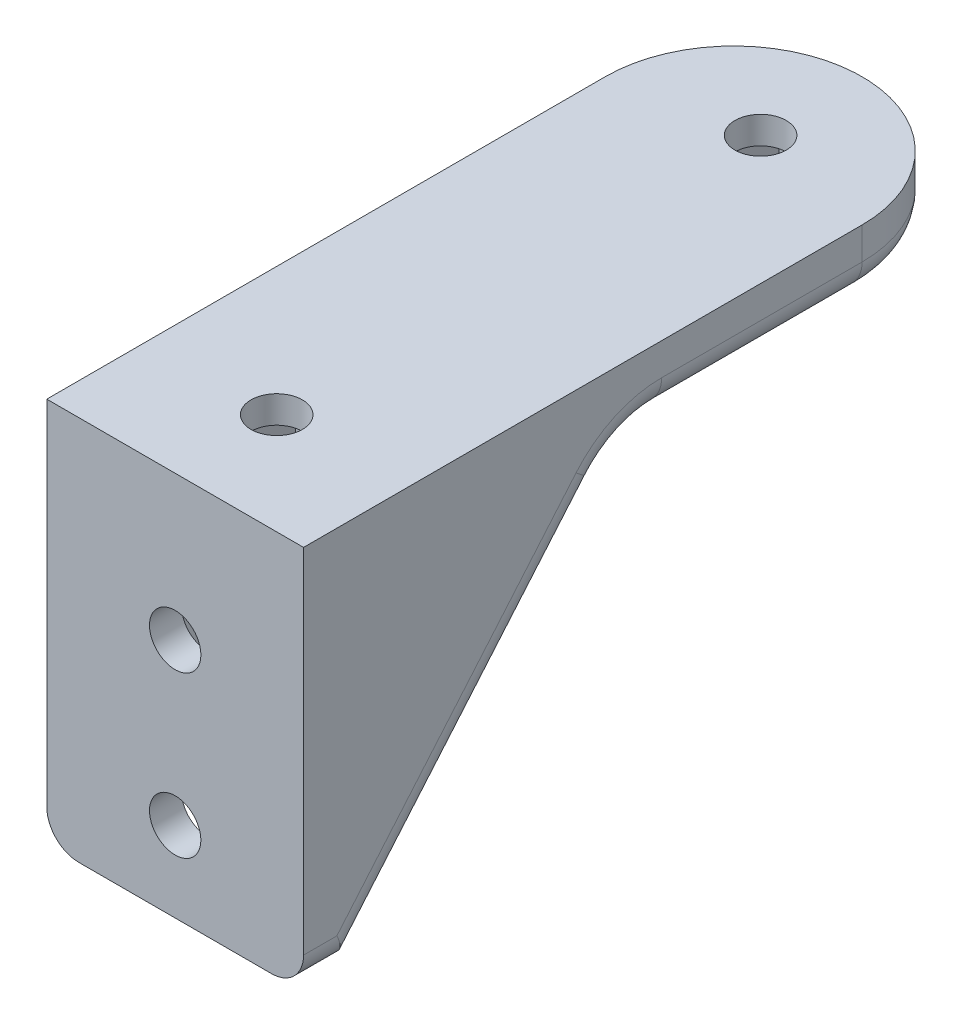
ISO-10303-21;
HEADER;
FILE_DESCRIPTION(('STEP AP214'),'2;1');
FILE_NAME('part.step','',(''),(''),'','','');
FILE_SCHEMA(('AUTOMOTIVE_DESIGN { 1 0 10303 214 1 1 1 1 }'));
ENDSEC;
DATA;
#1=APPLICATION_CONTEXT('core data for automotive mechanical design processes');
#2=APPLICATION_PROTOCOL_DEFINITION('international standard','automotive_design',2000,#1);
#3=PRODUCT_CONTEXT('',#1,'mechanical');
#4=PRODUCT('Part','Part','',(#3));
#5=PRODUCT_RELATED_PRODUCT_CATEGORY('part','',(#4));
#6=PRODUCT_DEFINITION_FORMATION('','',#4);
#7=PRODUCT_DEFINITION_CONTEXT('part definition',#1,'design');
#8=PRODUCT_DEFINITION('design','',#6,#7);
#9=PRODUCT_DEFINITION_SHAPE('','',#8);
#10=(LENGTH_UNIT() NAMED_UNIT(*) SI_UNIT(.MILLI.,.METRE.));
#11=(NAMED_UNIT(*) PLANE_ANGLE_UNIT() SI_UNIT($,.RADIAN.));
#12=(NAMED_UNIT(*) SI_UNIT($,.STERADIAN.) SOLID_ANGLE_UNIT());
#13=UNCERTAINTY_MEASURE_WITH_UNIT(LENGTH_MEASURE(1.E-05),#10,'distance_accuracy_value','');
#14=(GEOMETRIC_REPRESENTATION_CONTEXT(3) GLOBAL_UNCERTAINTY_ASSIGNED_CONTEXT((#13)) GLOBAL_UNIT_ASSIGNED_CONTEXT((#10,
#11,#12)) REPRESENTATION_CONTEXT('',''));
#15=CARTESIAN_POINT('',(0.,0.,0.));
#16=DIRECTION('',(0.,0.,1.));
#17=DIRECTION('',(1.,0.,0.));
#18=AXIS2_PLACEMENT_3D('',#15,#16,#17);
#19=CARTESIAN_POINT('',(0.,-15.,21.4));
#20=DIRECTION('',(0.,0.,-1.));
#21=DIRECTION('',(-1.,0.,0.));
#22=AXIS2_PLACEMENT_3D('',#19,#20,#21);
#23=CYLINDRICAL_SURFACE('',#22,1.6);
#24=CARTESIAN_POINT('',(0.,-15.,21.4));
#25=DIRECTION('',(0.,0.,-1.));
#26=DIRECTION('',(1.,0.,0.));
#27=AXIS2_PLACEMENT_3D('',#24,#25,#26);
#28=CIRCLE('',#27,1.6);
#29=CARTESIAN_POINT('',(1.6,-15.,21.4));
#30=VERTEX_POINT('',#29);
#31=EDGE_CURVE('E384',#30,#30,#28,.T.);
#32=ORIENTED_EDGE('',*,*,#31,.F.);
#33=EDGE_LOOP('',(#32));
#34=FACE_BOUND('',#33,.T.);
#35=CARTESIAN_POINT('',(0.,-15.,19.4));
#36=DIRECTION('',(0.,0.,-1.));
#37=DIRECTION('',(-1.,0.,0.));
#38=AXIS2_PLACEMENT_3D('',#35,#36,#37);
#39=CIRCLE('',#38,1.6);
#40=CARTESIAN_POINT('',(-1.6,-15.,19.4));
#41=VERTEX_POINT('',#40);
#42=EDGE_CURVE('E386',#41,#41,#39,.F.);
#43=ORIENTED_EDGE('',*,*,#42,.F.);
#44=EDGE_LOOP('',(#43));
#45=FACE_BOUND('',#44,.T.);
#46=ADVANCED_FACE('F39',(#34,#45),#23,.F.);
#47=CARTESIAN_POINT('',(0.,-5.,21.4));
#48=DIRECTION('',(0.,0.,-1.));
#49=DIRECTION('',(-1.,0.,0.));
#50=AXIS2_PLACEMENT_3D('',#47,#48,#49);
#51=CYLINDRICAL_SURFACE('',#50,1.6);
#52=CARTESIAN_POINT('',(0.,-5.,21.4));
#53=DIRECTION('',(0.,0.,-1.));
#54=DIRECTION('',(-1.,0.,0.));
#55=AXIS2_PLACEMENT_3D('',#52,#53,#54);
#56=CIRCLE('',#55,1.6);
#57=CARTESIAN_POINT('',(-1.6,-5.,21.4));
#58=VERTEX_POINT('',#57);
#59=EDGE_CURVE('E736',#58,#58,#56,.T.);
#60=ORIENTED_EDGE('',*,*,#59,.F.);
#61=EDGE_LOOP('',(#60));
#62=FACE_BOUND('',#61,.T.);
#63=CARTESIAN_POINT('',(0.,-5.,19.4));
#64=DIRECTION('',(0.,0.,-1.));
#65=DIRECTION('',(-1.,0.,0.));
#66=AXIS2_PLACEMENT_3D('',#63,#64,#65);
#67=CIRCLE('',#66,1.6);
#68=CARTESIAN_POINT('',(-1.6,-5.,19.4));
#69=VERTEX_POINT('',#68);
#70=EDGE_CURVE('E381',#69,#69,#67,.F.);
#71=ORIENTED_EDGE('',*,*,#70,.F.);
#72=EDGE_LOOP('',(#71));
#73=FACE_BOUND('',#72,.T.);
#74=ADVANCED_FACE('F501',(#62,#73),#51,.F.);
#75=CARTESIAN_POINT('',(0.,0.,-13.4));
#76=DIRECTION('',(0.,1.,0.));
#77=DIRECTION('',(0.,0.,1.));
#78=AXIS2_PLACEMENT_3D('',#75,#76,#77);
#79=PLANE('',#78);
#80=DIRECTION('',(0.5,0.,-0.866025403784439));
#81=VECTOR('',#80,1.);
#82=CARTESIAN_POINT('',(-3.17542648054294,0.,-15.075));
#83=LINE('',#82,#81);
#84=CARTESIAN_POINT('',(-3.17542648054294,0.,-15.075));
#85=VERTEX_POINT('',#84);
#86=CARTESIAN_POINT('',(-1.58771324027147,0.,-17.825));
#87=VERTEX_POINT('',#86);
#88=EDGE_CURVE('E323',#85,#87,#83,.T.);
#89=ORIENTED_EDGE('',*,*,#88,.F.);
#90=DIRECTION('',(-0.499999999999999,0.,-0.866025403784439));
#91=VECTOR('',#90,1.);
#92=CARTESIAN_POINT('',(-1.58771324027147,0.,-12.325));
#93=LINE('',#92,#91);
#94=CARTESIAN_POINT('',(-1.58771324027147,0.,-12.325));
#95=VERTEX_POINT('',#94);
#96=EDGE_CURVE('E321',#95,#85,#93,.T.);
#97=ORIENTED_EDGE('',*,*,#96,.F.);
#98=DIRECTION('',(-1.,0.,0.));
#99=VECTOR('',#98,1.);
#100=CARTESIAN_POINT('',(1.58771324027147,0.,-12.325));
#101=LINE('',#100,#99);
#102=CARTESIAN_POINT('',(1.58771324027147,0.,-12.325));
#103=VERTEX_POINT('',#102);
#104=EDGE_CURVE('E305',#103,#95,#101,.T.);
#105=ORIENTED_EDGE('',*,*,#104,.F.);
#106=DIRECTION('',(-0.5,0.,0.866025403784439));
#107=VECTOR('',#106,1.);
#108=CARTESIAN_POINT('',(3.17542648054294,0.,-15.075));
#109=LINE('',#108,#107);
#110=CARTESIAN_POINT('',(3.17542648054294,0.,-15.075));
#111=VERTEX_POINT('',#110);
#112=EDGE_CURVE('E332',#111,#103,#109,.T.);
#113=ORIENTED_EDGE('',*,*,#112,.F.);
#114=DIRECTION('',(0.5,0.,0.866025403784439));
#115=VECTOR('',#114,1.);
#116=CARTESIAN_POINT('',(1.58771324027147,0.,-17.825));
#117=LINE('',#116,#115);
#118=CARTESIAN_POINT('',(1.58771324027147,0.,-17.825));
#119=VERTEX_POINT('',#118);
#120=EDGE_CURVE('E329',#119,#111,#117,.T.);
#121=ORIENTED_EDGE('',*,*,#120,.F.);
#122=DIRECTION('',(1.,0.,0.));
#123=VECTOR('',#122,1.);
#124=CARTESIAN_POINT('',(-1.58771324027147,0.,-17.825));
#125=LINE('',#124,#123);
#126=EDGE_CURVE('E326',#87,#119,#125,.T.);
#127=ORIENTED_EDGE('',*,*,#126,.F.);
#128=EDGE_LOOP('',(#89,#97,#105,#113,#121,#127));
#129=FACE_BOUND('',#128,.T.);
#130=DIRECTION('',(1.,0.,0.));
#131=VECTOR('',#130,1.);
#132=CARTESIAN_POINT('',(-8.00000000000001,0.,-0.912202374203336));
#133=LINE('',#132,#131);
#134=CARTESIAN_POINT('',(-5.00000000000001,0.,-0.912202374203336));
#135=VERTEX_POINT('',#134);
#136=CARTESIAN_POINT('',(-6.00000000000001,0.,-0.912202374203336));
#137=VERTEX_POINT('',#136);
#138=EDGE_CURVE('E428',#135,#137,#133,.F.);
#139=ORIENTED_EDGE('',*,*,#138,.T.);
#140=DIRECTION('',(0.,0.,1.));
#141=VECTOR('',#140,1.);
#142=CARTESIAN_POINT('',(-6.00000000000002,0.,-13.4));
#143=LINE('',#142,#141);
#144=CARTESIAN_POINT('',(-6.00000000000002,0.,-13.4));
#145=VERTEX_POINT('',#144);
#146=EDGE_CURVE('E636',#137,#145,#143,.F.);
#147=ORIENTED_EDGE('',*,*,#146,.T.);
#148=CARTESIAN_POINT('',(0.,0.,-13.4));
#149=DIRECTION('',(0.,1.,0.));
#150=DIRECTION('',(0.,0.,1.));
#151=AXIS2_PLACEMENT_3D('',#148,#149,#150);
#152=CIRCLE('',#151,6.00000000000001);
#153=CARTESIAN_POINT('',(6.00000000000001,0.,-13.4));
#154=VERTEX_POINT('',#153);
#155=EDGE_CURVE('E640',#145,#154,#152,.F.);
#156=ORIENTED_EDGE('',*,*,#155,.T.);
#157=DIRECTION('',(0.,0.,-1.));
#158=VECTOR('',#157,1.);
#159=CARTESIAN_POINT('',(6.00000000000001,0.,-13.4));
#160=LINE('',#159,#158);
#161=CARTESIAN_POINT('',(6.00000000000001,0.,-0.912202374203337));
#162=VERTEX_POINT('',#161);
#163=EDGE_CURVE('E627',#154,#162,#160,.F.);
#164=ORIENTED_EDGE('',*,*,#163,.T.);
#165=DIRECTION('',(1.,0.,0.));
#166=VECTOR('',#165,1.);
#167=CARTESIAN_POINT('',(5.00000000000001,0.,-0.912202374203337));
#168=LINE('',#167,#166);
#169=CARTESIAN_POINT('',(5.00000000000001,0.,-0.912202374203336));
#170=VERTEX_POINT('',#169);
#171=EDGE_CURVE('E420',#162,#170,#168,.F.);
#172=ORIENTED_EDGE('',*,*,#171,.T.);
#173=DIRECTION('',(0.,0.,-1.));
#174=VECTOR('',#173,1.);
#175=CARTESIAN_POINT('',(5.00000000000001,0.,18.4));
#176=LINE('',#175,#174);
#177=CARTESIAN_POINT('',(5.00000000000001,0.,18.4));
#178=VERTEX_POINT('',#177);
#179=EDGE_CURVE('E400',#170,#178,#176,.F.);
#180=ORIENTED_EDGE('',*,*,#179,.T.);
#181=DIRECTION('',(1.,0.,0.));
#182=VECTOR('',#181,1.);
#183=CARTESIAN_POINT('',(6.00000000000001,0.,18.4));
#184=LINE('',#183,#182);
#185=CARTESIAN_POINT('',(-5.,0.,18.4));
#186=VERTEX_POINT('',#185);
#187=EDGE_CURVE('E269',#186,#178,#184,.T.);
#188=ORIENTED_EDGE('',*,*,#187,.F.);
#189=DIRECTION('',(0.,0.,1.));
#190=VECTOR('',#189,1.);
#191=CARTESIAN_POINT('',(-5.00000000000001,0.,1.40000000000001));
#192=LINE('',#191,#190);
#193=EDGE_CURVE('E402',#186,#135,#192,.F.);
#194=ORIENTED_EDGE('',*,*,#193,.T.);
#195=EDGE_LOOP('',(#139,#147,#156,#164,#172,#180,#188,#194));
#196=FACE_BOUND('',#195,.T.);
#197=DIRECTION('',(0.5,0.,-0.866025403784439));
#198=VECTOR('',#197,1.);
#199=CARTESIAN_POINT('',(-3.17542648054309,0.,15.0749999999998));
#200=LINE('',#199,#198);
#201=CARTESIAN_POINT('',(-3.17542648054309,0.,15.0749999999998));
#202=VERTEX_POINT('',#201);
#203=CARTESIAN_POINT('',(-1.58771324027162,0.,12.3249999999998));
#204=VERTEX_POINT('',#203);
#205=EDGE_CURVE('E280',#202,#204,#200,.T.);
#206=ORIENTED_EDGE('',*,*,#205,.F.);
#207=DIRECTION('',(-0.499999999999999,0.,-0.866025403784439));
#208=VECTOR('',#207,1.);
#209=CARTESIAN_POINT('',(-1.58771324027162,0.,17.8249999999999));
#210=LINE('',#209,#208);
#211=CARTESIAN_POINT('',(-1.58771324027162,0.,17.8249999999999));
#212=VERTEX_POINT('',#211);
#213=EDGE_CURVE('E245',#212,#202,#210,.T.);
#214=ORIENTED_EDGE('',*,*,#213,.F.);
#215=DIRECTION('',(-1.,0.,0.));
#216=VECTOR('',#215,1.);
#217=CARTESIAN_POINT('',(1.58771324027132,0.,17.8249999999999));
#218=LINE('',#217,#216);
#219=CARTESIAN_POINT('',(1.58771324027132,0.,17.8249999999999));
#220=VERTEX_POINT('',#219);
#221=EDGE_CURVE('E263',#220,#212,#218,.T.);
#222=ORIENTED_EDGE('',*,*,#221,.F.);
#223=DIRECTION('',(-0.5,0.,0.866025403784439));
#224=VECTOR('',#223,1.);
#225=CARTESIAN_POINT('',(3.17542648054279,0.,15.0749999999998));
#226=LINE('',#225,#224);
#227=CARTESIAN_POINT('',(3.17542648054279,0.,15.0749999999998));
#228=VERTEX_POINT('',#227);
#229=EDGE_CURVE('E266',#228,#220,#226,.T.);
#230=ORIENTED_EDGE('',*,*,#229,.F.);
#231=DIRECTION('',(0.5,0.,0.866025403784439));
#232=VECTOR('',#231,1.);
#233=CARTESIAN_POINT('',(1.58771324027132,0.,12.3249999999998));
#234=LINE('',#233,#232);
#235=CARTESIAN_POINT('',(1.58771324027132,0.,12.3249999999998));
#236=VERTEX_POINT('',#235);
#237=EDGE_CURVE('E286',#236,#228,#234,.T.);
#238=ORIENTED_EDGE('',*,*,#237,.F.);
#239=DIRECTION('',(1.,0.,0.));
#240=VECTOR('',#239,1.);
#241=CARTESIAN_POINT('',(-1.58771324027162,0.,12.3249999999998));
#242=LINE('',#241,#240);
#243=EDGE_CURVE('E283',#204,#236,#242,.T.);
#244=ORIENTED_EDGE('',*,*,#243,.F.);
#245=EDGE_LOOP('',(#206,#214,#222,#230,#238,#244));
#246=FACE_BOUND('',#245,.T.);
#247=ADVANCED_FACE('F507',(#129,#196,#246),#79,.F.);
#248=CARTESIAN_POINT('',(0.,4.,15.075));
#249=DIRECTION('',(0.,-1.,0.));
#250=DIRECTION('',(0.,0.,-1.));
#251=AXIS2_PLACEMENT_3D('',#248,#249,#250);
#252=CYLINDRICAL_SURFACE('',#251,1.6);
#253=CARTESIAN_POINT('',(0.,4.,15.075));
#254=DIRECTION('',(0.,1.,0.));
#255=DIRECTION('',(0.,0.,-1.));
#256=AXIS2_PLACEMENT_3D('',#253,#254,#255);
#257=CIRCLE('',#256,1.6);
#258=CARTESIAN_POINT('',(0.,4.,13.475));
#259=VERTEX_POINT('',#258);
#260=EDGE_CURVE('E350',#259,#259,#257,.T.);
#261=ORIENTED_EDGE('',*,*,#260,.T.);
#262=EDGE_LOOP('',(#261));
#263=FACE_BOUND('',#262,.T.);
#264=CARTESIAN_POINT('',(0.,2.3,15.075));
#265=DIRECTION('',(0.,-1.,0.));
#266=DIRECTION('',(0.,0.,-1.));
#267=AXIS2_PLACEMENT_3D('',#264,#265,#266);
#268=CIRCLE('',#267,1.6);
#269=CARTESIAN_POINT('',(0.,2.3,13.475));
#270=VERTEX_POINT('',#269);
#271=EDGE_CURVE('E293',#270,#270,#268,.T.);
#272=ORIENTED_EDGE('',*,*,#271,.T.);
#273=EDGE_LOOP('',(#272));
#274=FACE_BOUND('',#273,.T.);
#275=ADVANCED_FACE('F584',(#263,#274),#252,.F.);
#276=CARTESIAN_POINT('',(0.,4.,-15.075));
#277=DIRECTION('',(0.,-1.,0.));
#278=DIRECTION('',(0.,0.,-1.));
#279=AXIS2_PLACEMENT_3D('',#276,#277,#278);
#280=CYLINDRICAL_SURFACE('',#279,1.6);
#281=CARTESIAN_POINT('',(0.,4.,-15.075));
#282=DIRECTION('',(0.,1.,0.));
#283=DIRECTION('',(0.,0.,1.));
#284=AXIS2_PLACEMENT_3D('',#281,#282,#283);
#285=CIRCLE('',#284,1.6);
#286=CARTESIAN_POINT('',(0.,4.,-13.475));
#287=VERTEX_POINT('',#286);
#288=EDGE_CURVE('E353',#287,#287,#285,.T.);
#289=ORIENTED_EDGE('',*,*,#288,.T.);
#290=EDGE_LOOP('',(#289));
#291=FACE_BOUND('',#290,.T.);
#292=CARTESIAN_POINT('',(0.,2.3,-15.075));
#293=DIRECTION('',(0.,-1.,0.));
#294=DIRECTION('',(0.,0.,-1.));
#295=AXIS2_PLACEMENT_3D('',#292,#293,#294);
#296=CIRCLE('',#295,1.6);
#297=CARTESIAN_POINT('',(0.,2.3,-16.675));
#298=VERTEX_POINT('',#297);
#299=EDGE_CURVE('E339',#298,#298,#296,.T.);
#300=ORIENTED_EDGE('',*,*,#299,.T.);
#301=EDGE_LOOP('',(#300));
#302=FACE_BOUND('',#301,.T.);
#303=ADVANCED_FACE('F587',(#291,#302),#280,.F.);
#304=CARTESIAN_POINT('',(0.,4.,-13.4));
#305=DIRECTION('',(0.,1.,0.));
#306=DIRECTION('',(0.,0.,1.));
#307=AXIS2_PLACEMENT_3D('',#304,#305,#306);
#308=PLANE('',#307);
#309=ORIENTED_EDGE('',*,*,#288,.F.);
#310=EDGE_LOOP('',(#309));
#311=FACE_BOUND('',#310,.T.);
#312=CARTESIAN_POINT('',(0.,4.,-13.4));
#313=DIRECTION('',(0.,1.,0.));
#314=DIRECTION('',(0.,0.,1.));
#315=AXIS2_PLACEMENT_3D('',#312,#313,#314);
#316=CIRCLE('',#315,8.00000000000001);
#317=CARTESIAN_POINT('',(8.00000000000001,4.,-13.4));
#318=VERTEX_POINT('',#317);
#319=CARTESIAN_POINT('',(-8.00000000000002,4.,-13.4));
#320=VERTEX_POINT('',#319);
#321=EDGE_CURVE('E356',#318,#320,#316,.T.);
#322=ORIENTED_EDGE('',*,*,#321,.T.);
#323=DIRECTION('',(0.,0.,1.));
#324=VECTOR('',#323,1.);
#325=CARTESIAN_POINT('',(-8.00000000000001,4.,21.4));
#326=LINE('',#325,#324);
#327=CARTESIAN_POINT('',(-8.00000000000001,4.,21.4));
#328=VERTEX_POINT('',#327);
#329=EDGE_CURVE('E359',#320,#328,#326,.T.);
#330=ORIENTED_EDGE('',*,*,#329,.T.);
#331=DIRECTION('',(1.,0.,0.));
#332=VECTOR('',#331,1.);
#333=CARTESIAN_POINT('',(8.00000000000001,4.,21.4));
#334=LINE('',#333,#332);
#335=CARTESIAN_POINT('',(8.00000000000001,4.,21.4));
#336=VERTEX_POINT('',#335);
#337=EDGE_CURVE('E361',#328,#336,#334,.T.);
#338=ORIENTED_EDGE('',*,*,#337,.T.);
#339=DIRECTION('',(0.,0.,-1.));
#340=VECTOR('',#339,1.);
#341=CARTESIAN_POINT('',(8.00000000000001,4.,-13.4));
#342=LINE('',#341,#340);
#343=EDGE_CURVE('E363',#336,#318,#342,.T.);
#344=ORIENTED_EDGE('',*,*,#343,.T.);
#345=EDGE_LOOP('',(#322,#330,#338,#344));
#346=FACE_BOUND('',#345,.T.);
#347=ORIENTED_EDGE('',*,*,#260,.F.);
#348=EDGE_LOOP('',(#347));
#349=FACE_BOUND('',#348,.T.);
#350=ADVANCED_FACE('F591',(#311,#346,#349),#308,.T.);
#351=CARTESIAN_POINT('',(0.,4.,-13.4));
#352=DIRECTION('',(0.,-1.,0.));
#353=DIRECTION('',(0.,0.,-1.));
#354=AXIS2_PLACEMENT_3D('',#351,#352,#353);
#355=CYLINDRICAL_SURFACE('',#354,8.00000000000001);
#356=DIRECTION('',(0.,-1.,0.));
#357=VECTOR('',#356,1.);
#358=CARTESIAN_POINT('',(8.00000000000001,4.,-13.4));
#359=LINE('',#358,#357);
#360=CARTESIAN_POINT('',(8.00000000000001,2.,-13.4));
#361=VERTEX_POINT('',#360);
#362=EDGE_CURVE('E365',#318,#361,#359,.T.);
#363=ORIENTED_EDGE('',*,*,#362,.T.);
#364=CARTESIAN_POINT('',(0.,2.,-13.4));
#365=DIRECTION('',(0.,1.,0.));
#366=DIRECTION('',(0.,0.,1.));
#367=AXIS2_PLACEMENT_3D('',#364,#365,#366);
#368=CIRCLE('',#367,8.00000000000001);
#369=CARTESIAN_POINT('',(-8.00000000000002,2.,-13.4));
#370=VERTEX_POINT('',#369);
#371=EDGE_CURVE('E619',#361,#370,#368,.T.);
#372=ORIENTED_EDGE('',*,*,#371,.T.);
#373=DIRECTION('',(0.,-1.,0.));
#374=VECTOR('',#373,1.);
#375=CARTESIAN_POINT('',(-8.00000000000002,4.,-13.4));
#376=LINE('',#375,#374);
#377=EDGE_CURVE('E373',#320,#370,#376,.T.);
#378=ORIENTED_EDGE('',*,*,#377,.F.);
#379=ORIENTED_EDGE('',*,*,#321,.F.);
#380=EDGE_LOOP('',(#363,#372,#378,#379));
#381=FACE_BOUND('',#380,.T.);
#382=ADVANCED_FACE('F595',(#381),#355,.T.);
#383=CARTESIAN_POINT('',(-8.00000000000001,4.,21.4));
#384=DIRECTION('',(1.,0.,0.));
#385=DIRECTION('',(0.,0.,-1.));
#386=AXIS2_PLACEMENT_3D('',#383,#384,#385);
#387=PLANE('',#386);
#388=ORIENTED_EDGE('',*,*,#377,.T.);
#389=DIRECTION('',(0.,0.,1.));
#390=VECTOR('',#389,1.);
#391=CARTESIAN_POINT('',(-8.00000000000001,2.,21.4));
#392=LINE('',#391,#390);
#393=CARTESIAN_POINT('',(-8.00000000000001,2.,-0.912202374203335));
#394=VERTEX_POINT('',#393);
#395=EDGE_CURVE('E699',#370,#394,#392,.T.);
#396=ORIENTED_EDGE('',*,*,#395,.T.);
#397=CARTESIAN_POINT('',(-8.00000000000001,-5.,-0.912202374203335));
#398=DIRECTION('',(1.,0.,0.));
#399=DIRECTION('',(0.,0.,-1.));
#400=AXIS2_PLACEMENT_3D('',#397,#398,#399);
#401=CIRCLE('',#400,7.);
#402=CARTESIAN_POINT('',(-8.00000000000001,-0.466461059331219,4.42137285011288));
#403=VERTEX_POINT('',#402);
#404=EDGE_CURVE('E702',#394,#403,#401,.T.);
#405=ORIENTED_EDGE('',*,*,#404,.T.);
#406=DIRECTION('',(0.,-0.761939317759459,0.64764842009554));
#407=VECTOR('',#406,1.);
#408=CARTESIAN_POINT('',(-8.00000000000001,-6.25187297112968,9.33897297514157));
#409=LINE('',#408,#407);
#410=CARTESIAN_POINT('',(-8.00000000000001,-18.,19.3248809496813));
#411=VERTEX_POINT('',#410);
#412=EDGE_CURVE('E713',#403,#411,#409,.T.);
#413=ORIENTED_EDGE('',*,*,#412,.T.);
#414=DIRECTION('',(0.,0.,-1.));
#415=VECTOR('',#414,1.);
#416=CARTESIAN_POINT('',(-8.00000000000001,-18.,21.4));
#417=LINE('',#416,#415);
#418=CARTESIAN_POINT('',(-8.00000000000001,-18.,21.4));
#419=VERTEX_POINT('',#418);
#420=EDGE_CURVE('E685',#411,#419,#417,.F.);
#421=ORIENTED_EDGE('',*,*,#420,.T.);
#422=DIRECTION('',(0.,-1.,0.));
#423=VECTOR('',#422,1.);
#424=CARTESIAN_POINT('',(-8.00000000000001,4.,21.4));
#425=LINE('',#424,#423);
#426=EDGE_CURVE('E371',#328,#419,#425,.T.);
#427=ORIENTED_EDGE('',*,*,#426,.F.);
#428=ORIENTED_EDGE('',*,*,#329,.F.);
#429=EDGE_LOOP('',(#388,#396,#405,#413,#421,#427,#428));
#430=FACE_BOUND('',#429,.T.);
#431=ADVANCED_FACE('F606',(#430),#387,.F.);
#432=CARTESIAN_POINT('',(8.00000000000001,4.,21.4));
#433=DIRECTION('',(0.,0.,-1.));
#434=DIRECTION('',(-1.,0.,0.));
#435=AXIS2_PLACEMENT_3D('',#432,#433,#434);
#436=PLANE('',#435);
#437=ORIENTED_EDGE('',*,*,#31,.T.);
#438=EDGE_LOOP('',(#437));
#439=FACE_BOUND('',#438,.T.);
#440=ORIENTED_EDGE('',*,*,#59,.T.);
#441=EDGE_LOOP('',(#440));
#442=FACE_BOUND('',#441,.T.);
#443=ORIENTED_EDGE('',*,*,#426,.T.);
#444=CARTESIAN_POINT('',(-6.00000000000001,-18.,21.4));
#445=DIRECTION('',(0.,0.,-1.));
#446=DIRECTION('',(-1.,0.,0.));
#447=AXIS2_PLACEMENT_3D('',#444,#445,#446);
#448=CIRCLE('',#447,2.);
#449=CARTESIAN_POINT('',(-6.00000000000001,-20.,21.4));
#450=VERTEX_POINT('',#449);
#451=EDGE_CURVE('E48',#419,#450,#448,.F.);
#452=ORIENTED_EDGE('',*,*,#451,.T.);
#453=DIRECTION('',(-1.,0.,0.));
#454=VECTOR('',#453,1.);
#455=CARTESIAN_POINT('',(8.00000000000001,-20.,21.4));
#456=LINE('',#455,#454);
#457=CARTESIAN_POINT('',(6.00000000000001,-20.,21.4));
#458=VERTEX_POINT('',#457);
#459=EDGE_CURVE('E678',#458,#450,#456,.T.);
#460=ORIENTED_EDGE('',*,*,#459,.F.);
#461=CARTESIAN_POINT('',(6.00000000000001,-18.,21.4));
#462=DIRECTION('',(0.,0.,-1.));
#463=DIRECTION('',(-1.,0.,0.));
#464=AXIS2_PLACEMENT_3D('',#461,#462,#463);
#465=CIRCLE('',#464,2.);
#466=CARTESIAN_POINT('',(8.00000000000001,-18.,21.4));
#467=VERTEX_POINT('',#466);
#468=EDGE_CURVE('E653',#458,#467,#465,.F.);
#469=ORIENTED_EDGE('',*,*,#468,.T.);
#470=DIRECTION('',(0.,-1.,0.));
#471=VECTOR('',#470,1.);
#472=CARTESIAN_POINT('',(8.00000000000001,4.,21.4));
#473=LINE('',#472,#471);
#474=EDGE_CURVE('E368',#336,#467,#473,.T.);
#475=ORIENTED_EDGE('',*,*,#474,.F.);
#476=ORIENTED_EDGE('',*,*,#337,.F.);
#477=EDGE_LOOP('',(#443,#452,#460,#469,#475,#476));
#478=FACE_BOUND('',#477,.T.);
#479=ADVANCED_FACE('F602',(#439,#442,#478),#436,.F.);
#480=CARTESIAN_POINT('',(8.00000000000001,4.,-13.4));
#481=DIRECTION('',(-1.,0.,0.));
#482=DIRECTION('',(0.,0.,1.));
#483=AXIS2_PLACEMENT_3D('',#480,#481,#482);
#484=PLANE('',#483);
#485=CARTESIAN_POINT('',(8.00000000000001,-5.,-0.912202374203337));
#486=DIRECTION('',(-1.,0.,0.));
#487=DIRECTION('',(0.,0.,1.));
#488=AXIS2_PLACEMENT_3D('',#485,#486,#487);
#489=CIRCLE('',#488,7.);
#490=CARTESIAN_POINT('',(8.00000000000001,-0.466461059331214,4.42137285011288));
#491=VERTEX_POINT('',#490);
#492=CARTESIAN_POINT('',(8.00000000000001,2.,-0.912202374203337));
#493=VERTEX_POINT('',#492);
#494=EDGE_CURVE('E645',#491,#493,#489,.T.);
#495=ORIENTED_EDGE('',*,*,#494,.T.);
#496=DIRECTION('',(0.,0.,-1.));
#497=VECTOR('',#496,1.);
#498=CARTESIAN_POINT('',(8.00000000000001,2.,-13.4));
#499=LINE('',#498,#497);
#500=EDGE_CURVE('E626',#493,#361,#499,.T.);
#501=ORIENTED_EDGE('',*,*,#500,.T.);
#502=ORIENTED_EDGE('',*,*,#362,.F.);
#503=ORIENTED_EDGE('',*,*,#343,.F.);
#504=ORIENTED_EDGE('',*,*,#474,.T.);
#505=DIRECTION('',(0.,0.,1.));
#506=VECTOR('',#505,1.);
#507=CARTESIAN_POINT('',(8.00000000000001,-18.,18.4));
#508=LINE('',#507,#506);
#509=CARTESIAN_POINT('',(8.00000000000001,-18.,19.3248809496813));
#510=VERTEX_POINT('',#509);
#511=EDGE_CURVE('E638',#467,#510,#508,.F.);
#512=ORIENTED_EDGE('',*,*,#511,.T.);
#513=DIRECTION('',(0.,-0.761939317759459,0.64764842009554));
#514=VECTOR('',#513,1.);
#515=CARTESIAN_POINT('',(8.00000000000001,10.9208411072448,-5.25783399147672));
#516=LINE('',#515,#514);
#517=EDGE_CURVE('E635',#510,#491,#516,.F.);
#518=ORIENTED_EDGE('',*,*,#517,.T.);
#519=EDGE_LOOP('',(#495,#501,#502,#503,#504,#512,#518));
#520=FACE_BOUND('',#519,.T.);
#521=ADVANCED_FACE('F582',(#520),#484,.F.);
#522=CARTESIAN_POINT('',(-1.58771324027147,2.3,-12.325));
#523=DIRECTION('',(-0.866025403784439,0.,0.5));
#524=DIRECTION('',(0.5,0.,0.866025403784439));
#525=AXIS2_PLACEMENT_3D('',#522,#523,#524);
#526=PLANE('',#525);
#527=ORIENTED_EDGE('',*,*,#96,.T.);
#528=DIRECTION('',(0.,-1.,0.));
#529=VECTOR('',#528,1.);
#530=CARTESIAN_POINT('',(-3.17542648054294,2.3,-15.075));
#531=LINE('',#530,#529);
#532=CARTESIAN_POINT('',(-3.17542648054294,2.3,-15.075));
#533=VERTEX_POINT('',#532);
#534=EDGE_CURVE('E320',#533,#85,#531,.T.);
#535=ORIENTED_EDGE('',*,*,#534,.F.);
#536=DIRECTION('',(-0.499999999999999,0.,-0.866025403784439));
#537=VECTOR('',#536,1.);
#538=CARTESIAN_POINT('',(-1.58771324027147,2.3,-12.325));
#539=LINE('',#538,#537);
#540=CARTESIAN_POINT('',(-1.58771324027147,2.3,-12.325));
#541=VERTEX_POINT('',#540);
#542=EDGE_CURVE('E301',#541,#533,#539,.T.);
#543=ORIENTED_EDGE('',*,*,#542,.F.);
#544=DIRECTION('',(0.,-1.,0.));
#545=VECTOR('',#544,1.);
#546=CARTESIAN_POINT('',(-1.58771324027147,2.3,-12.325));
#547=LINE('',#546,#545);
#548=EDGE_CURVE('E337',#541,#95,#547,.T.);
#549=ORIENTED_EDGE('',*,*,#548,.T.);
#550=EDGE_LOOP('',(#527,#535,#543,#549));
#551=FACE_BOUND('',#550,.T.);
#552=ADVANCED_FACE('F564',(#551),#526,.F.);
#553=CARTESIAN_POINT('',(1.58771324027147,2.3,-12.325));
#554=DIRECTION('',(0.,0.,1.));
#555=DIRECTION('',(1.,0.,0.));
#556=AXIS2_PLACEMENT_3D('',#553,#554,#555);
#557=PLANE('',#556);
#558=ORIENTED_EDGE('',*,*,#104,.T.);
#559=ORIENTED_EDGE('',*,*,#548,.F.);
#560=DIRECTION('',(-1.,0.,0.));
#561=VECTOR('',#560,1.);
#562=CARTESIAN_POINT('',(1.58771324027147,2.3,-12.325));
#563=LINE('',#562,#561);
#564=CARTESIAN_POINT('',(1.58771324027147,2.3,-12.325));
#565=VERTEX_POINT('',#564);
#566=EDGE_CURVE('E317',#565,#541,#563,.T.);
#567=ORIENTED_EDGE('',*,*,#566,.F.);
#568=DIRECTION('',(0.,-1.,0.));
#569=VECTOR('',#568,1.);
#570=CARTESIAN_POINT('',(1.58771324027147,2.3,-12.325));
#571=LINE('',#570,#569);
#572=EDGE_CURVE('E340',#565,#103,#571,.T.);
#573=ORIENTED_EDGE('',*,*,#572,.T.);
#574=EDGE_LOOP('',(#558,#559,#567,#573));
#575=FACE_BOUND('',#574,.T.);
#576=ADVANCED_FACE('F560',(#575),#557,.F.);
#577=CARTESIAN_POINT('',(3.17542648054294,2.3,-15.075));
#578=DIRECTION('',(0.866025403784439,0.,0.5));
#579=DIRECTION('',(0.5,0.,-0.866025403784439));
#580=AXIS2_PLACEMENT_3D('',#577,#578,#579);
#581=PLANE('',#580);
#582=ORIENTED_EDGE('',*,*,#112,.T.);
#583=ORIENTED_EDGE('',*,*,#572,.F.);
#584=DIRECTION('',(-0.5,0.,0.866025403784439));
#585=VECTOR('',#584,1.);
#586=CARTESIAN_POINT('',(3.17542648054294,2.3,-15.075));
#587=LINE('',#586,#585);
#588=CARTESIAN_POINT('',(3.17542648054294,2.3,-15.075));
#589=VERTEX_POINT('',#588);
#590=EDGE_CURVE('E314',#589,#565,#587,.T.);
#591=ORIENTED_EDGE('',*,*,#590,.F.);
#592=DIRECTION('',(0.,-1.,0.));
#593=VECTOR('',#592,1.);
#594=CARTESIAN_POINT('',(3.17542648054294,2.3,-15.075));
#595=LINE('',#594,#593);
#596=EDGE_CURVE('E342',#589,#111,#595,.T.);
#597=ORIENTED_EDGE('',*,*,#596,.T.);
#598=EDGE_LOOP('',(#582,#583,#591,#597));
#599=FACE_BOUND('',#598,.T.);
#600=ADVANCED_FACE('F563',(#599),#581,.F.);
#601=CARTESIAN_POINT('',(1.58771324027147,2.3,-17.825));
#602=DIRECTION('',(0.866025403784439,0.,-0.5));
#603=DIRECTION('',(-0.5,0.,-0.866025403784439));
#604=AXIS2_PLACEMENT_3D('',#601,#602,#603);
#605=PLANE('',#604);
#606=ORIENTED_EDGE('',*,*,#120,.T.);
#607=ORIENTED_EDGE('',*,*,#596,.F.);
#608=DIRECTION('',(0.5,0.,0.866025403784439));
#609=VECTOR('',#608,1.);
#610=CARTESIAN_POINT('',(1.58771324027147,2.3,-17.825));
#611=LINE('',#610,#609);
#612=CARTESIAN_POINT('',(1.58771324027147,2.3,-17.825));
#613=VERTEX_POINT('',#612);
#614=EDGE_CURVE('E311',#613,#589,#611,.T.);
#615=ORIENTED_EDGE('',*,*,#614,.F.);
#616=DIRECTION('',(0.,-1.,0.));
#617=VECTOR('',#616,1.);
#618=CARTESIAN_POINT('',(1.58771324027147,2.3,-17.825));
#619=LINE('',#618,#617);
#620=EDGE_CURVE('E344',#613,#119,#619,.T.);
#621=ORIENTED_EDGE('',*,*,#620,.T.);
#622=EDGE_LOOP('',(#606,#607,#615,#621));
#623=FACE_BOUND('',#622,.T.);
#624=ADVANCED_FACE('F568',(#623),#605,.F.);
#625=CARTESIAN_POINT('',(-1.58771324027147,2.3,-17.825));
#626=DIRECTION('',(0.,0.,-1.));
#627=DIRECTION('',(-1.,0.,0.));
#628=AXIS2_PLACEMENT_3D('',#625,#626,#627);
#629=PLANE('',#628);
#630=ORIENTED_EDGE('',*,*,#126,.T.);
#631=ORIENTED_EDGE('',*,*,#620,.F.);
#632=DIRECTION('',(1.,0.,0.));
#633=VECTOR('',#632,1.);
#634=CARTESIAN_POINT('',(-1.58771324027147,2.3,-17.825));
#635=LINE('',#634,#633);
#636=CARTESIAN_POINT('',(-1.58771324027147,2.3,-17.825));
#637=VERTEX_POINT('',#636);
#638=EDGE_CURVE('E308',#637,#613,#635,.T.);
#639=ORIENTED_EDGE('',*,*,#638,.F.);
#640=DIRECTION('',(0.,-1.,0.));
#641=VECTOR('',#640,1.);
#642=CARTESIAN_POINT('',(-1.58771324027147,2.3,-17.825));
#643=LINE('',#642,#641);
#644=EDGE_CURVE('E346',#637,#87,#643,.T.);
#645=ORIENTED_EDGE('',*,*,#644,.T.);
#646=EDGE_LOOP('',(#630,#631,#639,#645));
#647=FACE_BOUND('',#646,.T.);
#648=ADVANCED_FACE('F572',(#647),#629,.F.);
#649=CARTESIAN_POINT('',(-3.17542648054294,2.3,-15.075));
#650=DIRECTION('',(-0.866025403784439,0.,-0.5));
#651=DIRECTION('',(-0.5,0.,0.866025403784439));
#652=AXIS2_PLACEMENT_3D('',#649,#650,#651);
#653=PLANE('',#652);
#654=ORIENTED_EDGE('',*,*,#88,.T.);
#655=ORIENTED_EDGE('',*,*,#644,.F.);
#656=DIRECTION('',(0.5,0.,-0.866025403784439));
#657=VECTOR('',#656,1.);
#658=CARTESIAN_POINT('',(-3.17542648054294,2.3,-15.075));
#659=LINE('',#658,#657);
#660=EDGE_CURVE('E304',#533,#637,#659,.T.);
#661=ORIENTED_EDGE('',*,*,#660,.F.);
#662=ORIENTED_EDGE('',*,*,#534,.T.);
#663=EDGE_LOOP('',(#654,#655,#661,#662));
#664=FACE_BOUND('',#663,.T.);
#665=ADVANCED_FACE('F558',(#664),#653,.F.);
#666=CARTESIAN_POINT('',(0.,2.3,0.));
#667=DIRECTION('',(0.,-1.,0.));
#668=DIRECTION('',(0.,0.,-1.));
#669=AXIS2_PLACEMENT_3D('',#666,#667,#668);
#670=PLANE('',#669);
#671=ORIENTED_EDGE('',*,*,#299,.F.);
#672=EDGE_LOOP('',(#671));
#673=FACE_BOUND('',#672,.T.);
#674=ORIENTED_EDGE('',*,*,#542,.T.);
#675=ORIENTED_EDGE('',*,*,#660,.T.);
#676=ORIENTED_EDGE('',*,*,#638,.T.);
#677=ORIENTED_EDGE('',*,*,#614,.T.);
#678=ORIENTED_EDGE('',*,*,#590,.T.);
#679=ORIENTED_EDGE('',*,*,#566,.T.);
#680=EDGE_LOOP('',(#674,#675,#676,#677,#678,#679));
#681=FACE_BOUND('',#680,.T.);
#682=ADVANCED_FACE('F555',(#673,#681),#670,.T.);
#683=CARTESIAN_POINT('',(-1.58771324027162,2.3,17.8249999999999));
#684=DIRECTION('',(-0.866025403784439,0.,0.499999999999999));
#685=DIRECTION('',(0.499999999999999,0.,0.866025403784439));
#686=AXIS2_PLACEMENT_3D('',#683,#684,#685);
#687=PLANE('',#686);
#688=ORIENTED_EDGE('',*,*,#213,.T.);
#689=DIRECTION('',(0.,-1.,0.));
#690=VECTOR('',#689,1.);
#691=CARTESIAN_POINT('',(-3.17542648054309,2.3,15.0749999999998));
#692=LINE('',#691,#690);
#693=CARTESIAN_POINT('',(-3.17542648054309,2.3,15.0749999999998));
#694=VERTEX_POINT('',#693);
#695=EDGE_CURVE('E238',#694,#202,#692,.T.);
#696=ORIENTED_EDGE('',*,*,#695,.F.);
#697=DIRECTION('',(-0.499999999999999,0.,-0.866025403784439));
#698=VECTOR('',#697,1.);
#699=CARTESIAN_POINT('',(-1.58771324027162,2.3,17.8249999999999));
#700=LINE('',#699,#698);
#701=CARTESIAN_POINT('',(-1.58771324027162,2.3,17.8249999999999));
#702=VERTEX_POINT('',#701);
#703=EDGE_CURVE('E242',#702,#694,#700,.T.);
#704=ORIENTED_EDGE('',*,*,#703,.F.);
#705=DIRECTION('',(0.,-1.,0.));
#706=VECTOR('',#705,1.);
#707=CARTESIAN_POINT('',(-1.58771324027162,2.3,17.8249999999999));
#708=LINE('',#707,#706);
#709=EDGE_CURVE('E291',#702,#212,#708,.T.);
#710=ORIENTED_EDGE('',*,*,#709,.T.);
#711=EDGE_LOOP('',(#688,#696,#704,#710));
#712=FACE_BOUND('',#711,.T.);
#713=ADVANCED_FACE('F240',(#712),#687,.F.);
#714=CARTESIAN_POINT('',(1.58771324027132,2.3,17.8249999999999));
#715=DIRECTION('',(0.,0.,1.));
#716=DIRECTION('',(1.,0.,0.));
#717=AXIS2_PLACEMENT_3D('',#714,#715,#716);
#718=PLANE('',#717);
#719=ORIENTED_EDGE('',*,*,#221,.T.);
#720=ORIENTED_EDGE('',*,*,#709,.F.);
#721=DIRECTION('',(-1.,0.,0.));
#722=VECTOR('',#721,1.);
#723=CARTESIAN_POINT('',(1.58771324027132,2.3,17.8249999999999));
#724=LINE('',#723,#722);
#725=CARTESIAN_POINT('',(1.58771324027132,2.3,17.8249999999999));
#726=VERTEX_POINT('',#725);
#727=EDGE_CURVE('E250',#726,#702,#724,.T.);
#728=ORIENTED_EDGE('',*,*,#727,.F.);
#729=DIRECTION('',(0.,-1.,0.));
#730=VECTOR('',#729,1.);
#731=CARTESIAN_POINT('',(1.58771324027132,2.3,17.8249999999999));
#732=LINE('',#731,#730);
#733=EDGE_CURVE('E294',#726,#220,#732,.T.);
#734=ORIENTED_EDGE('',*,*,#733,.T.);
#735=EDGE_LOOP('',(#719,#720,#728,#734));
#736=FACE_BOUND('',#735,.T.);
#737=ADVANCED_FACE('F535',(#736),#718,.F.);
#738=CARTESIAN_POINT('',(3.17542648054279,2.3,15.0749999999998));
#739=DIRECTION('',(0.866025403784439,0.,0.5));
#740=DIRECTION('',(0.5,0.,-0.866025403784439));
#741=AXIS2_PLACEMENT_3D('',#738,#739,#740);
#742=PLANE('',#741);
#743=ORIENTED_EDGE('',*,*,#229,.T.);
#744=ORIENTED_EDGE('',*,*,#733,.F.);
#745=DIRECTION('',(-0.5,0.,0.866025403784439));
#746=VECTOR('',#745,1.);
#747=CARTESIAN_POINT('',(3.17542648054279,2.3,15.0749999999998));
#748=LINE('',#747,#746);
#749=CARTESIAN_POINT('',(3.17542648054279,2.3,15.0749999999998));
#750=VERTEX_POINT('',#749);
#751=EDGE_CURVE('E276',#750,#726,#748,.T.);
#752=ORIENTED_EDGE('',*,*,#751,.F.);
#753=DIRECTION('',(0.,-1.,0.));
#754=VECTOR('',#753,1.);
#755=CARTESIAN_POINT('',(3.17542648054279,2.3,15.0749999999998));
#756=LINE('',#755,#754);
#757=EDGE_CURVE('E296',#750,#228,#756,.T.);
#758=ORIENTED_EDGE('',*,*,#757,.T.);
#759=EDGE_LOOP('',(#743,#744,#752,#758));
#760=FACE_BOUND('',#759,.T.);
#761=ADVANCED_FACE('F538',(#760),#742,.F.);
#762=CARTESIAN_POINT('',(1.58771324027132,2.3,12.3249999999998));
#763=DIRECTION('',(0.866025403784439,0.,-0.5));
#764=DIRECTION('',(-0.5,0.,-0.866025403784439));
#765=AXIS2_PLACEMENT_3D('',#762,#763,#764);
#766=PLANE('',#765);
#767=ORIENTED_EDGE('',*,*,#237,.T.);
#768=ORIENTED_EDGE('',*,*,#757,.F.);
#769=DIRECTION('',(0.5,0.,0.866025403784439));
#770=VECTOR('',#769,1.);
#771=CARTESIAN_POINT('',(1.58771324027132,2.3,12.3249999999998));
#772=LINE('',#771,#770);
#773=CARTESIAN_POINT('',(1.58771324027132,2.3,12.3249999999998));
#774=VERTEX_POINT('',#773);
#775=EDGE_CURVE('E273',#774,#750,#772,.T.);
#776=ORIENTED_EDGE('',*,*,#775,.F.);
#777=DIRECTION('',(0.,-1.,0.));
#778=VECTOR('',#777,1.);
#779=CARTESIAN_POINT('',(1.58771324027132,2.3,12.3249999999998));
#780=LINE('',#779,#778);
#781=EDGE_CURVE('E298',#774,#236,#780,.T.);
#782=ORIENTED_EDGE('',*,*,#781,.T.);
#783=EDGE_LOOP('',(#767,#768,#776,#782));
#784=FACE_BOUND('',#783,.T.);
#785=ADVANCED_FACE('F542',(#784),#766,.F.);
#786=CARTESIAN_POINT('',(-1.58771324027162,2.3,12.3249999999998));
#787=DIRECTION('',(0.,0.,-1.));
#788=DIRECTION('',(-1.,0.,0.));
#789=AXIS2_PLACEMENT_3D('',#786,#787,#788);
#790=PLANE('',#789);
#791=ORIENTED_EDGE('',*,*,#243,.T.);
#792=ORIENTED_EDGE('',*,*,#781,.F.);
#793=DIRECTION('',(1.,0.,0.));
#794=VECTOR('',#793,1.);
#795=CARTESIAN_POINT('',(-1.58771324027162,2.3,12.3249999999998));
#796=LINE('',#795,#794);
#797=CARTESIAN_POINT('',(-1.58771324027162,2.3,12.3249999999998));
#798=VERTEX_POINT('',#797);
#799=EDGE_CURVE('E258',#798,#774,#796,.T.);
#800=ORIENTED_EDGE('',*,*,#799,.F.);
#801=DIRECTION('',(0.,-1.,0.));
#802=VECTOR('',#801,1.);
#803=CARTESIAN_POINT('',(-1.58771324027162,2.3,12.3249999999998));
#804=LINE('',#803,#802);
#805=EDGE_CURVE('E249',#798,#204,#804,.T.);
#806=ORIENTED_EDGE('',*,*,#805,.T.);
#807=EDGE_LOOP('',(#791,#792,#800,#806));
#808=FACE_BOUND('',#807,.T.);
#809=ADVANCED_FACE('F546',(#808),#790,.F.);
#810=CARTESIAN_POINT('',(-3.17542648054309,2.3,15.0749999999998));
#811=DIRECTION('',(-0.866025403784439,0.,-0.5));
#812=DIRECTION('',(-0.5,0.,0.866025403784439));
#813=AXIS2_PLACEMENT_3D('',#810,#811,#812);
#814=PLANE('',#813);
#815=ORIENTED_EDGE('',*,*,#205,.T.);
#816=ORIENTED_EDGE('',*,*,#805,.F.);
#817=DIRECTION('',(0.5,0.,-0.866025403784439));
#818=VECTOR('',#817,1.);
#819=CARTESIAN_POINT('',(-3.17542648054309,2.3,15.0749999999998));
#820=LINE('',#819,#818);
#821=EDGE_CURVE('E253',#694,#798,#820,.T.);
#822=ORIENTED_EDGE('',*,*,#821,.F.);
#823=ORIENTED_EDGE('',*,*,#695,.T.);
#824=EDGE_LOOP('',(#815,#816,#822,#823));
#825=FACE_BOUND('',#824,.T.);
#826=ADVANCED_FACE('F254',(#825),#814,.F.);
#827=CARTESIAN_POINT('',(0.,2.3,0.));
#828=DIRECTION('',(0.,-1.,0.));
#829=DIRECTION('',(0.,0.,-1.));
#830=AXIS2_PLACEMENT_3D('',#827,#828,#829);
#831=PLANE('',#830);
#832=ORIENTED_EDGE('',*,*,#271,.F.);
#833=EDGE_LOOP('',(#832));
#834=FACE_BOUND('',#833,.T.);
#835=ORIENTED_EDGE('',*,*,#703,.T.);
#836=ORIENTED_EDGE('',*,*,#821,.T.);
#837=ORIENTED_EDGE('',*,*,#799,.T.);
#838=ORIENTED_EDGE('',*,*,#775,.T.);
#839=ORIENTED_EDGE('',*,*,#751,.T.);
#840=ORIENTED_EDGE('',*,*,#727,.T.);
#841=EDGE_LOOP('',(#835,#836,#837,#838,#839,#840));
#842=FACE_BOUND('',#841,.T.);
#843=ADVANCED_FACE('F260',(#834,#842),#831,.T.);
#844=CARTESIAN_POINT('',(-6.00000000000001,-20.,18.4));
#845=DIRECTION('',(-1.,0.,0.));
#846=DIRECTION('',(0.,0.,1.));
#847=AXIS2_PLACEMENT_3D('',#844,#845,#846);
#848=PLANE('',#847);
#849=DIRECTION('',(0.,0.761939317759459,-0.64764842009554));
#850=VECTOR('',#849,1.);
#851=CARTESIAN_POINT('',(-6.00000000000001,-20.,18.4));
#852=LINE('',#851,#850);
#853=CARTESIAN_POINT('',(-6.00000000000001,-18.8235294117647,17.4));
#854=VERTEX_POINT('',#853);
#855=CARTESIAN_POINT('',(-6.00000000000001,-1.7617578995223,2.89749421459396));
#856=VERTEX_POINT('',#855);
#857=EDGE_CURVE('E697',#854,#856,#852,.T.);
#858=ORIENTED_EDGE('',*,*,#857,.T.);
#859=CARTESIAN_POINT('',(-6.00000000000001,-5.,-0.912202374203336));
#860=DIRECTION('',(-1.,0.,0.));
#861=DIRECTION('',(0.,0.,1.));
#862=AXIS2_PLACEMENT_3D('',#859,#860,#861);
#863=CIRCLE('',#862,5.);
#864=CARTESIAN_POINT('',(-6.00000000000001,-1.,2.08779762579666));
#865=VERTEX_POINT('',#864);
#866=EDGE_CURVE('E431',#856,#865,#863,.T.);
#867=ORIENTED_EDGE('',*,*,#866,.T.);
#868=DIRECTION('',(0.,0.,1.));
#869=VECTOR('',#868,1.);
#870=CARTESIAN_POINT('',(-6.00000000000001,-1.,18.4));
#871=LINE('',#870,#869);
#872=CARTESIAN_POINT('',(-6.00000000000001,-1.,17.4));
#873=VERTEX_POINT('',#872);
#874=EDGE_CURVE('E397',#865,#873,#871,.T.);
#875=ORIENTED_EDGE('',*,*,#874,.T.);
#876=DIRECTION('',(0.,1.,0.));
#877=VECTOR('',#876,1.);
#878=CARTESIAN_POINT('',(-6.00000000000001,-20.,17.4));
#879=LINE('',#878,#877);
#880=EDGE_CURVE('E394',#873,#854,#879,.F.);
#881=ORIENTED_EDGE('',*,*,#880,.T.);
#882=EDGE_LOOP('',(#858,#867,#875,#881));
#883=FACE_BOUND('',#882,.T.);
#884=ADVANCED_FACE('F527',(#883),#848,.F.);
#885=CARTESIAN_POINT('',(6.00000000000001,-20.,18.4));
#886=DIRECTION('',(0.,0.,1.));
#887=DIRECTION('',(1.,0.,0.));
#888=AXIS2_PLACEMENT_3D('',#885,#886,#887);
#889=PLANE('',#888);
#890=CARTESIAN_POINT('',(0.,-15.,18.4));
#891=DIRECTION('',(0.,0.,-1.));
#892=DIRECTION('',(-1.,0.,0.));
#893=AXIS2_PLACEMENT_3D('',#890,#891,#892);
#894=CIRCLE('',#893,4.1);
#895=CARTESIAN_POINT('',(-4.1,-15.,18.4));
#896=VERTEX_POINT('',#895);
#897=EDGE_CURVE('E745',#896,#896,#894,.T.);
#898=ORIENTED_EDGE('',*,*,#897,.F.);
#899=EDGE_LOOP('',(#898));
#900=FACE_BOUND('',#899,.T.);
#901=CARTESIAN_POINT('',(0.,-5.,18.4));
#902=DIRECTION('',(0.,0.,-1.));
#903=DIRECTION('',(-1.,0.,0.));
#904=AXIS2_PLACEMENT_3D('',#901,#902,#903);
#905=CIRCLE('',#904,4.1);
#906=CARTESIAN_POINT('',(-4.1,-5.,18.4));
#907=VERTEX_POINT('',#906);
#908=EDGE_CURVE('E389',#907,#907,#905,.T.);
#909=ORIENTED_EDGE('',*,*,#908,.F.);
#910=EDGE_LOOP('',(#909));
#911=FACE_BOUND('',#910,.T.);
#912=DIRECTION('',(1.,0.,0.));
#913=VECTOR('',#912,1.);
#914=CARTESIAN_POINT('',(6.00000000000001,-20.,18.4));
#915=LINE('',#914,#913);
#916=CARTESIAN_POINT('',(-5.,-20.,18.4));
#917=VERTEX_POINT('',#916);
#918=CARTESIAN_POINT('',(5.00000000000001,-20.,18.4));
#919=VERTEX_POINT('',#918);
#920=EDGE_CURVE('E281',#917,#919,#915,.T.);
#921=ORIENTED_EDGE('',*,*,#920,.F.);
#922=DIRECTION('',(0.,1.,0.));
#923=VECTOR('',#922,1.);
#924=CARTESIAN_POINT('',(-5.,0.,18.4));
#925=LINE('',#924,#923);
#926=EDGE_CURVE('E407',#917,#186,#925,.T.);
#927=ORIENTED_EDGE('',*,*,#926,.T.);
#928=ORIENTED_EDGE('',*,*,#187,.T.);
#929=DIRECTION('',(0.,1.,0.));
#930=VECTOR('',#929,1.);
#931=CARTESIAN_POINT('',(5.00000000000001,-20.,18.4));
#932=LINE('',#931,#930);
#933=EDGE_CURVE('E404',#178,#919,#932,.F.);
#934=ORIENTED_EDGE('',*,*,#933,.T.);
#935=EDGE_LOOP('',(#921,#927,#928,#934));
#936=FACE_BOUND('',#935,.T.);
#937=ADVANCED_FACE('F523',(#900,#911,#936),#889,.F.);
#938=CARTESIAN_POINT('',(6.00000000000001,-20.,18.4));
#939=DIRECTION('',(1.,0.,0.));
#940=DIRECTION('',(0.,0.,-1.));
#941=AXIS2_PLACEMENT_3D('',#938,#939,#940);
#942=PLANE('',#941);
#943=DIRECTION('',(0.,1.,0.));
#944=VECTOR('',#943,1.);
#945=CARTESIAN_POINT('',(6.00000000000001,0.,17.4));
#946=LINE('',#945,#944);
#947=CARTESIAN_POINT('',(6.00000000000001,-18.8235294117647,17.4));
#948=VERTEX_POINT('',#947);
#949=CARTESIAN_POINT('',(6.00000000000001,-1.,17.4));
#950=VERTEX_POINT('',#949);
#951=EDGE_CURVE('E409',#948,#950,#946,.T.);
#952=ORIENTED_EDGE('',*,*,#951,.T.);
#953=DIRECTION('',(0.,0.,-1.));
#954=VECTOR('',#953,1.);
#955=CARTESIAN_POINT('',(6.00000000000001,-1.,1.40000000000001));
#956=LINE('',#955,#954);
#957=CARTESIAN_POINT('',(6.00000000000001,-1.,2.08779762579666));
#958=VERTEX_POINT('',#957);
#959=EDGE_CURVE('E411',#950,#958,#956,.T.);
#960=ORIENTED_EDGE('',*,*,#959,.T.);
#961=CARTESIAN_POINT('',(6.00000000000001,-5.,-0.912202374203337));
#962=DIRECTION('',(1.,0.,0.));
#963=DIRECTION('',(0.,0.,-1.));
#964=AXIS2_PLACEMENT_3D('',#961,#962,#963);
#965=CIRCLE('',#964,5.);
#966=CARTESIAN_POINT('',(6.00000000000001,-1.7617578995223,2.89749421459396));
#967=VERTEX_POINT('',#966);
#968=EDGE_CURVE('E717',#958,#967,#965,.T.);
#969=ORIENTED_EDGE('',*,*,#968,.T.);
#970=DIRECTION('',(0.,-0.761939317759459,0.64764842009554));
#971=VECTOR('',#970,1.);
#972=CARTESIAN_POINT('',(6.00000000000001,-20.,18.4));
#973=LINE('',#972,#971);
#974=EDGE_CURVE('E423',#967,#948,#973,.T.);
#975=ORIENTED_EDGE('',*,*,#974,.T.);
#976=EDGE_LOOP('',(#952,#960,#969,#975));
#977=FACE_BOUND('',#976,.T.);
#978=ADVANCED_FACE('F520',(#977),#942,.F.);
#979=CARTESIAN_POINT('',(0.,-20.,0.));
#980=DIRECTION('',(0.,-1.,0.));
#981=DIRECTION('',(0.,0.,-1.));
#982=AXIS2_PLACEMENT_3D('',#979,#980,#981);
#983=PLANE('',#982);
#984=ORIENTED_EDGE('',*,*,#459,.T.);
#985=DIRECTION('',(0.,0.,-1.));
#986=VECTOR('',#985,1.);
#987=CARTESIAN_POINT('',(-6.00000000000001,-20.,18.4));
#988=LINE('',#987,#986);
#989=CARTESIAN_POINT('',(-6.00000000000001,-20.,18.4));
#990=VERTEX_POINT('',#989);
#991=EDGE_CURVE('E651',#450,#990,#988,.T.);
#992=ORIENTED_EDGE('',*,*,#991,.T.);
#993=DIRECTION('',(-1.,0.,0.));
#994=VECTOR('',#993,1.);
#995=CARTESIAN_POINT('',(0.,-20.,18.4));
#996=LINE('',#995,#994);
#997=EDGE_CURVE('E376',#917,#990,#996,.T.);
#998=ORIENTED_EDGE('',*,*,#997,.F.);
#999=ORIENTED_EDGE('',*,*,#920,.T.);
#1000=CARTESIAN_POINT('',(6.00000000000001,-20.,18.4));
#1001=VERTEX_POINT('',#1000);
#1002=EDGE_CURVE('E393',#1001,#919,#996,.T.);
#1003=ORIENTED_EDGE('',*,*,#1002,.F.);
#1004=DIRECTION('',(0.,0.,1.));
#1005=VECTOR('',#1004,1.);
#1006=CARTESIAN_POINT('',(6.00000000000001,-20.,21.4));
#1007=LINE('',#1006,#1005);
#1008=EDGE_CURVE('E62',#1001,#458,#1007,.T.);
#1009=ORIENTED_EDGE('',*,*,#1008,.T.);
#1010=EDGE_LOOP('',(#984,#992,#998,#999,#1003,#1009));
#1011=FACE_BOUND('',#1010,.T.);
#1012=ADVANCED_FACE('F516',(#1011),#983,.T.);
#1013=CARTESIAN_POINT('',(0.,-5.,19.4));
#1014=DIRECTION('',(0.,0.,-1.));
#1015=DIRECTION('',(-1.,0.,0.));
#1016=AXIS2_PLACEMENT_3D('',#1013,#1014,#1015);
#1017=PLANE('',#1016);
#1018=CARTESIAN_POINT('',(0.,-5.,19.4));
#1019=DIRECTION('',(0.,0.,-1.));
#1020=DIRECTION('',(-1.,0.,0.));
#1021=AXIS2_PLACEMENT_3D('',#1018,#1019,#1020);
#1022=CIRCLE('',#1021,4.1);
#1023=CARTESIAN_POINT('',(-4.1,-5.,19.4));
#1024=VERTEX_POINT('',#1023);
#1025=EDGE_CURVE('E385',#1024,#1024,#1022,.T.);
#1026=ORIENTED_EDGE('',*,*,#1025,.T.);
#1027=EDGE_LOOP('',(#1026));
#1028=FACE_BOUND('',#1027,.T.);
#1029=ORIENTED_EDGE('',*,*,#70,.T.);
#1030=EDGE_LOOP('',(#1029));
#1031=FACE_BOUND('',#1030,.T.);
#1032=ADVANCED_FACE('F519',(#1028,#1031),#1017,.T.);
#1033=CARTESIAN_POINT('',(0.,-5.,19.4));
#1034=DIRECTION('',(0.,0.,-1.));
#1035=DIRECTION('',(-1.,0.,0.));
#1036=AXIS2_PLACEMENT_3D('',#1033,#1034,#1035);
#1037=CYLINDRICAL_SURFACE('',#1036,4.1);
#1038=ORIENTED_EDGE('',*,*,#1025,.F.);
#1039=EDGE_LOOP('',(#1038));
#1040=FACE_BOUND('',#1039,.T.);
#1041=ORIENTED_EDGE('',*,*,#908,.T.);
#1042=EDGE_LOOP('',(#1041));
#1043=FACE_BOUND('',#1042,.T.);
#1044=ADVANCED_FACE('F513',(#1040,#1043),#1037,.F.);
#1045=CARTESIAN_POINT('',(0.,-15.,19.4));
#1046=DIRECTION('',(0.,0.,-1.));
#1047=DIRECTION('',(-1.,0.,0.));
#1048=AXIS2_PLACEMENT_3D('',#1045,#1046,#1047);
#1049=PLANE('',#1048);
#1050=CARTESIAN_POINT('',(0.,-15.,19.4));
#1051=DIRECTION('',(0.,0.,-1.));
#1052=DIRECTION('',(-1.,0.,0.));
#1053=AXIS2_PLACEMENT_3D('',#1050,#1051,#1052);
#1054=CIRCLE('',#1053,4.1);
#1055=CARTESIAN_POINT('',(-4.1,-15.,19.4));
#1056=VERTEX_POINT('',#1055);
#1057=EDGE_CURVE('E390',#1056,#1056,#1054,.T.);
#1058=ORIENTED_EDGE('',*,*,#1057,.T.);
#1059=EDGE_LOOP('',(#1058));
#1060=FACE_BOUND('',#1059,.T.);
#1061=ORIENTED_EDGE('',*,*,#42,.T.);
#1062=EDGE_LOOP('',(#1061));
#1063=FACE_BOUND('',#1062,.T.);
#1064=ADVANCED_FACE('F879',(#1060,#1063),#1049,.T.);
#1065=CARTESIAN_POINT('',(0.,-15.,19.4));
#1066=DIRECTION('',(0.,0.,-1.));
#1067=DIRECTION('',(-1.,0.,0.));
#1068=AXIS2_PLACEMENT_3D('',#1065,#1066,#1067);
#1069=CYLINDRICAL_SURFACE('',#1068,4.1);
#1070=ORIENTED_EDGE('',*,*,#1057,.F.);
#1071=EDGE_LOOP('',(#1070));
#1072=FACE_BOUND('',#1071,.T.);
#1073=ORIENTED_EDGE('',*,*,#897,.T.);
#1074=EDGE_LOOP('',(#1073));
#1075=FACE_BOUND('',#1074,.T.);
#1076=ADVANCED_FACE('F871',(#1072,#1075),#1069,.F.);
#1077=CARTESIAN_POINT('',(-8.00005000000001,-20.,18.4));
#1078=DIRECTION('',(0.,0.64764842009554,0.761939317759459));
#1079=DIRECTION('',(0.,-0.761939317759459,0.64764842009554));
#1080=AXIS2_PLACEMENT_3D('',#1077,#1078,#1079);
#1081=PLANE('',#1080);
#1082=ORIENTED_EDGE('',*,*,#997,.T.);
#1083=DIRECTION('',(0.,-0.761939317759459,0.64764842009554));
#1084=VECTOR('',#1083,1.);
#1085=CARTESIAN_POINT('',(-6.00000000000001,-20.,18.4));
#1086=LINE('',#1085,#1084);
#1087=EDGE_CURVE('E692',#990,#854,#1086,.F.);
#1088=ORIENTED_EDGE('',*,*,#1087,.T.);
#1089=CARTESIAN_POINT('',(-5.,-18.8235294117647,17.4));
#1090=DIRECTION('',(0.,0.64764842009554,0.761939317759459));
#1091=DIRECTION('',(0.,-0.761939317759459,0.64764842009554));
#1092=AXIS2_PLACEMENT_3D('',#1089,#1090,#1091);
#1093=ELLIPSE('',#1092,1.54404761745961,1.);
#1094=EDGE_CURVE('E414',#854,#917,#1093,.T.);
#1095=ORIENTED_EDGE('',*,*,#1094,.T.);
#1096=EDGE_LOOP('',(#1082,#1088,#1095));
#1097=FACE_BOUND('',#1096,.T.);
#1098=ADVANCED_FACE('F691',(#1097),#1081,.F.);
#1099=CARTESIAN_POINT('',(5.00000000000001,-18.8235294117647,17.4));
#1100=DIRECTION('',(0.,0.64764842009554,0.761939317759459));
#1101=DIRECTION('',(0.,-0.761939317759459,0.64764842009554));
#1102=AXIS2_PLACEMENT_3D('',#1099,#1100,#1101);
#1103=ELLIPSE('',#1102,1.54404761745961,1.);
#1104=EDGE_CURVE('E417',#919,#948,#1103,.T.);
#1105=ORIENTED_EDGE('',*,*,#1104,.T.);
#1106=DIRECTION('',(0.,-0.761939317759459,0.64764842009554));
#1107=VECTOR('',#1106,1.);
#1108=CARTESIAN_POINT('',(6.00000000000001,-20.,18.4));
#1109=LINE('',#1108,#1107);
#1110=EDGE_CURVE('E11',#948,#1001,#1109,.T.);
#1111=ORIENTED_EDGE('',*,*,#1110,.T.);
#1112=ORIENTED_EDGE('',*,*,#1002,.T.);
#1113=EDGE_LOOP('',(#1105,#1111,#1112));
#1114=FACE_BOUND('',#1113,.T.);
#1115=ADVANCED_FACE('F764',(#1114),#1081,.F.);
#1116=CARTESIAN_POINT('',(-5.,-20.,17.4));
#1117=DIRECTION('',(0.,-1.,0.));
#1118=DIRECTION('',(0.,0.,-1.));
#1119=AXIS2_PLACEMENT_3D('',#1116,#1117,#1118);
#1120=CYLINDRICAL_SURFACE('',#1119,1.);
#1121=ORIENTED_EDGE('',*,*,#1094,.F.);
#1122=ORIENTED_EDGE('',*,*,#880,.F.);
#1123=CARTESIAN_POINT('',(-5.,-1.,17.4));
#1124=DIRECTION('',(0.,0.707106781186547,-0.707106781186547));
#1125=DIRECTION('',(0.,-0.707106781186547,-0.707106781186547));
#1126=AXIS2_PLACEMENT_3D('',#1123,#1124,#1125);
#1127=ELLIPSE('',#1126,1.41421356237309,1.);
#1128=EDGE_CURVE('E421',#186,#873,#1127,.F.);
#1129=ORIENTED_EDGE('',*,*,#1128,.F.);
#1130=ORIENTED_EDGE('',*,*,#926,.F.);
#1131=EDGE_LOOP('',(#1121,#1122,#1129,#1130));
#1132=FACE_BOUND('',#1131,.T.);
#1133=ADVANCED_FACE('F755',(#1132),#1120,.F.);
#1134=CARTESIAN_POINT('',(-5.00000000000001,-1.,18.4));
#1135=DIRECTION('',(0.,0.,-1.));
#1136=DIRECTION('',(-1.,0.,0.));
#1137=AXIS2_PLACEMENT_3D('',#1134,#1135,#1136);
#1138=CYLINDRICAL_SURFACE('',#1137,1.);
#1139=ORIENTED_EDGE('',*,*,#874,.F.);
#1140=CARTESIAN_POINT('',(-6.00000000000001,-1.,2.08779762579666));
#1141=CARTESIAN_POINT('',(-5.9999628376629,-0.952695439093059,2.02474232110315));
#1142=CARTESIAN_POINT('',(-5.99664751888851,-0.906948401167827,1.96062290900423));
#1143=CARTESIAN_POINT('',(-5.98446421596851,-0.818832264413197,1.83077990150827));
#1144=CARTESIAN_POINT('',(-5.97560680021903,-0.776456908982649,1.76505958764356));
#1145=CARTESIAN_POINT('',(-5.9534106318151,-0.695440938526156,1.63274533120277));
#1146=CARTESIAN_POINT('',(-5.94010261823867,-0.656776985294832,1.56616031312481));
#1147=CARTESIAN_POINT('',(-5.9097269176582,-0.58287395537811,1.43191193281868));
#1148=CARTESIAN_POINT('',(-5.89265676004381,-0.547637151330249,1.36424788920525));
#1149=CARTESIAN_POINT('',(-5.84353105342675,-0.459261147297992,1.18472754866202));
#1150=CARTESIAN_POINT('',(-5.80885369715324,-0.409005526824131,1.07216026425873));
#1151=CARTESIAN_POINT('',(-5.73330930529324,-0.317521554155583,0.84545316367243));
#1152=CARTESIAN_POINT('',(-5.69243965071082,-0.276297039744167,0.731312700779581));
#1153=CARTESIAN_POINT('',(-5.60598853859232,-0.202491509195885,0.501492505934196));
#1154=CARTESIAN_POINT('',(-5.56038938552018,-0.169944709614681,0.385808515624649));
#1155=CARTESIAN_POINT('',(-5.46595203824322,-0.113482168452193,0.153725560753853));
#1156=CARTESIAN_POINT('',(-5.41711489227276,-0.0895636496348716,0.037326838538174));
#1157=CARTESIAN_POINT('',(-5.3088464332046,-0.0468208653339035,-0.215678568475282));
#1158=CARTESIAN_POINT('',(-5.24901944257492,-0.0295404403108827,-0.352376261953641));
#1159=CARTESIAN_POINT('',(-5.12805007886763,-0.00632651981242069,-0.625829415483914));
#1160=CARTESIAN_POINT('',(-5.06691069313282,-0.000369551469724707,-0.762584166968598));
#1161=CARTESIAN_POINT('',(-5.00384898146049,-5.55844377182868E-06,-0.903595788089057));
#1162=CARTESIAN_POINT('',(-5.00192447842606,-3.22475619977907E-09,-0.907899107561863));
#1163=CARTESIAN_POINT('',(-5.00000000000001,0.,-0.912202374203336));
#1164=B_SPLINE_CURVE_WITH_KNOTS('',3,(#1140,#1141,#1142,#1143,#1144,#1145,#1146,#1147,#1148,
#1149,#1150,#1151,#1152,#1153,#1154,#1155,#1156,#1157,#1158,#1159,#1160,#1161,#1162,#1163),
.UNSPECIFIED.,.F.,.F.,(4,2,2,2,2,2,2,2,2,2,2,4),(0.,0.236272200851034,0.472095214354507,
0.706321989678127,0.940703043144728,1.32429275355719,1.70804515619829,2.09328905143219,
2.47840883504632,2.92860728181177,3.37787147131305,3.39201361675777),.UNSPECIFIED.);
#1165=EDGE_CURVE('E434',#865,#135,#1164,.T.);
#1166=ORIENTED_EDGE('',*,*,#1165,.T.);
#1167=ORIENTED_EDGE('',*,*,#193,.F.);
#1168=ORIENTED_EDGE('',*,*,#1128,.T.);
#1169=EDGE_LOOP('',(#1139,#1166,#1167,#1168));
#1170=FACE_BOUND('',#1169,.T.);
#1171=ADVANCED_FACE('F449',(#1170),#1138,.F.);
#1172=CARTESIAN_POINT('',(5.00000000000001,-20.,17.4));
#1173=DIRECTION('',(0.,-1.,0.));
#1174=DIRECTION('',(0.,0.,-1.));
#1175=AXIS2_PLACEMENT_3D('',#1172,#1173,#1174);
#1176=CYLINDRICAL_SURFACE('',#1175,1.);
#1177=ORIENTED_EDGE('',*,*,#1104,.F.);
#1178=ORIENTED_EDGE('',*,*,#933,.F.);
#1179=CARTESIAN_POINT('',(5.00000000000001,-1.,17.4));
#1180=DIRECTION('',(0.,-0.707106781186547,0.707106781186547));
#1181=DIRECTION('',(0.,0.707106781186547,0.707106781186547));
#1182=AXIS2_PLACEMENT_3D('',#1179,#1180,#1181);
#1183=ELLIPSE('',#1182,1.41421356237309,1.);
#1184=EDGE_CURVE('E424',#950,#178,#1183,.T.);
#1185=ORIENTED_EDGE('',*,*,#1184,.F.);
#1186=ORIENTED_EDGE('',*,*,#951,.F.);
#1187=EDGE_LOOP('',(#1177,#1178,#1185,#1186));
#1188=FACE_BOUND('',#1187,.T.);
#1189=ADVANCED_FACE('F460',(#1188),#1176,.F.);
#1190=CARTESIAN_POINT('',(5.00000000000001,-1.,18.4));
#1191=DIRECTION('',(0.,0.,1.));
#1192=DIRECTION('',(1.,0.,0.));
#1193=AXIS2_PLACEMENT_3D('',#1190,#1191,#1192);
#1194=CYLINDRICAL_SURFACE('',#1193,1.);
#1195=ORIENTED_EDGE('',*,*,#1184,.T.);
#1196=ORIENTED_EDGE('',*,*,#179,.F.);
#1197=CARTESIAN_POINT('',(6.00000000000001,-1.,2.08779762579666));
#1198=CARTESIAN_POINT('',(5.9999628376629,-0.952695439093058,2.02474232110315));
#1199=CARTESIAN_POINT('',(5.99664751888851,-0.906948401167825,1.96062290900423));
#1200=CARTESIAN_POINT('',(5.98446421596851,-0.818832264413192,1.83077990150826));
#1201=CARTESIAN_POINT('',(5.97560680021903,-0.776456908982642,1.76505958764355));
#1202=CARTESIAN_POINT('',(5.9534106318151,-0.695440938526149,1.63274533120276));
#1203=CARTESIAN_POINT('',(5.94010261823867,-0.656776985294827,1.5661603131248));
#1204=CARTESIAN_POINT('',(5.9097269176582,-0.582873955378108,1.43191193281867));
#1205=CARTESIAN_POINT('',(5.89265676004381,-0.547637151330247,1.36424788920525));
#1206=CARTESIAN_POINT('',(5.84353105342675,-0.459261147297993,1.18472754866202));
#1207=CARTESIAN_POINT('',(5.80885369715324,-0.409005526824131,1.07216026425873));
#1208=CARTESIAN_POINT('',(5.73330930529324,-0.317521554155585,0.845453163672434));
#1209=CARTESIAN_POINT('',(5.69243965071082,-0.27629703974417,0.731312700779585));
#1210=CARTESIAN_POINT('',(5.60598853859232,-0.202491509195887,0.5014925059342));
#1211=CARTESIAN_POINT('',(5.56038938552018,-0.169944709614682,0.385808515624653));
#1212=CARTESIAN_POINT('',(5.46595203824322,-0.113482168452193,0.153725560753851));
#1213=CARTESIAN_POINT('',(5.41711489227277,-0.0895636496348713,0.0373268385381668));
#1214=CARTESIAN_POINT('',(5.30884643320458,-0.0468208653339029,-0.215678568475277));
#1215=CARTESIAN_POINT('',(5.24901944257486,-0.0295404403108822,-0.352376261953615));
#1216=CARTESIAN_POINT('',(5.12805007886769,-0.00632651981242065,-0.625829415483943));
#1217=CARTESIAN_POINT('',(5.06691069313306,-0.000369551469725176,-0.762584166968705));
#1218=CARTESIAN_POINT('',(5.0038489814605,-5.55844377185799E-06,-0.903595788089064));
#1219=CARTESIAN_POINT('',(5.00192447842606,-3.22475621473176E-09,-0.907899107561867));
#1220=CARTESIAN_POINT('',(5.00000000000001,0.,-0.912202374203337));
#1221=B_SPLINE_CURVE_WITH_KNOTS('',3,(#1197,#1198,#1199,#1200,#1201,#1202,#1203,#1204,#1205,
#1206,#1207,#1208,#1209,#1210,#1211,#1212,#1213,#1214,#1215,#1216,#1217,#1218,#1219,#1220),
.UNSPECIFIED.,.F.,.F.,(4,2,2,2,2,2,2,2,2,2,2,4),(0.,0.236272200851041,0.472095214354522,
0.706321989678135,0.940703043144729,1.32429275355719,1.70804515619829,2.09328905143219,
2.47840883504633,2.92860728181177,3.37787147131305,3.39201361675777),.UNSPECIFIED.);
#1222=EDGE_CURVE('E442',#170,#958,#1221,.F.);
#1223=ORIENTED_EDGE('',*,*,#1222,.T.);
#1224=ORIENTED_EDGE('',*,*,#959,.F.);
#1225=EDGE_LOOP('',(#1195,#1196,#1223,#1224));
#1226=FACE_BOUND('',#1225,.T.);
#1227=ADVANCED_FACE('F458',(#1226),#1194,.F.);
#1228=CARTESIAN_POINT('',(-8.00005000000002,-5.,-0.912202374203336));
#1229=DIRECTION('',(-1.,0.,0.));
#1230=DIRECTION('',(0.,0.,1.));
#1231=AXIS2_PLACEMENT_3D('',#1228,#1229,#1230);
#1232=CYLINDRICAL_SURFACE('',#1231,5.);
#1233=ORIENTED_EDGE('',*,*,#1165,.F.);
#1234=CARTESIAN_POINT('',(-6.00000000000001,-5.,-0.912202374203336));
#1235=DIRECTION('',(1.,0.,0.));
#1236=DIRECTION('',(0.,0.,-1.));
#1237=AXIS2_PLACEMENT_3D('',#1234,#1235,#1236);
#1238=CIRCLE('',#1237,5.);
#1239=EDGE_CURVE('E698',#865,#137,#1238,.F.);
#1240=ORIENTED_EDGE('',*,*,#1239,.T.);
#1241=ORIENTED_EDGE('',*,*,#138,.F.);
#1242=EDGE_LOOP('',(#1233,#1240,#1241));
#1243=FACE_BOUND('',#1242,.T.);
#1244=ADVANCED_FACE('F453',(#1243),#1232,.F.);
#1245=CARTESIAN_POINT('',(-8.00005000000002,-5.,-0.912202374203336));
#1246=DIRECTION('',(-1.,0.,0.));
#1247=DIRECTION('',(0.,0.,1.));
#1248=AXIS2_PLACEMENT_3D('',#1245,#1246,#1247);
#1249=CYLINDRICAL_SURFACE('',#1248,5.);
#1250=ORIENTED_EDGE('',*,*,#171,.F.);
#1251=CARTESIAN_POINT('',(6.00000000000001,-5.,-0.912202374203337));
#1252=DIRECTION('',(-1.,0.,0.));
#1253=DIRECTION('',(0.,0.,1.));
#1254=AXIS2_PLACEMENT_3D('',#1251,#1252,#1253);
#1255=CIRCLE('',#1254,5.);
#1256=EDGE_CURVE('E648',#162,#958,#1255,.F.);
#1257=ORIENTED_EDGE('',*,*,#1256,.T.);
#1258=ORIENTED_EDGE('',*,*,#1222,.F.);
#1259=EDGE_LOOP('',(#1250,#1257,#1258));
#1260=FACE_BOUND('',#1259,.T.);
#1261=ADVANCED_FACE('F457',(#1260),#1249,.F.);
#1262=CARTESIAN_POINT('',(6.00000000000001,-18.,0.));
#1263=DIRECTION('',(0.,0.,-1.));
#1264=DIRECTION('',(-1.,0.,0.));
#1265=AXIS2_PLACEMENT_3D('',#1262,#1263,#1264);
#1266=CYLINDRICAL_SURFACE('',#1265,2.);
#1267=ORIENTED_EDGE('',*,*,#468,.F.);
#1268=ORIENTED_EDGE('',*,*,#1008,.F.);
#1269=CARTESIAN_POINT('',(6.00000000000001,-18.,19.3248809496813));
#1270=DIRECTION('',(0.,-0.419732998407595,0.907647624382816));
#1271=DIRECTION('',(0.,-0.907647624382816,-0.419732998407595));
#1272=AXIS2_PLACEMENT_3D('',#1269,#1270,#1271);
#1273=ELLIPSE('',#1272,2.20349830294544,2.);
#1274=EDGE_CURVE('E43',#510,#1001,#1273,.F.);
#1275=ORIENTED_EDGE('',*,*,#1274,.F.);
#1276=ORIENTED_EDGE('',*,*,#511,.F.);
#1277=EDGE_LOOP('',(#1267,#1268,#1275,#1276));
#1278=FACE_BOUND('',#1277,.T.);
#1279=ADVANCED_FACE('F41',(#1278),#1266,.T.);
#1280=CARTESIAN_POINT('',(6.00000000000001,-18.7047031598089,19.9238786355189));
#1281=DIRECTION('',(0.,-0.761939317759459,0.64764842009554));
#1282=DIRECTION('',(0.,-0.64764842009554,-0.761939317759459));
#1283=AXIS2_PLACEMENT_3D('',#1280,#1281,#1282);
#1284=CYLINDRICAL_SURFACE('',#1283,2.);
#1285=ORIENTED_EDGE('',*,*,#1110,.F.);
#1286=ORIENTED_EDGE('',*,*,#974,.F.);
#1287=CARTESIAN_POINT('',(6.00000000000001,-0.466461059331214,4.42137285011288));
#1288=DIRECTION('',(0.,0.761939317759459,-0.647648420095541));
#1289=DIRECTION('',(0.,0.647648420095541,0.761939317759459));
#1290=AXIS2_PLACEMENT_3D('',#1287,#1288,#1289);
#1291=CIRCLE('',#1290,2.);
#1292=EDGE_CURVE('E665',#491,#967,#1291,.T.);
#1293=ORIENTED_EDGE('',*,*,#1292,.F.);
#1294=ORIENTED_EDGE('',*,*,#517,.F.);
#1295=ORIENTED_EDGE('',*,*,#1274,.T.);
#1296=EDGE_LOOP('',(#1285,#1286,#1293,#1294,#1295));
#1297=FACE_BOUND('',#1296,.T.);
#1298=ADVANCED_FACE('F491',(#1297),#1284,.T.);
#1299=CARTESIAN_POINT('',(6.00000000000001,-5.,-0.912202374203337));
#1300=DIRECTION('',(-1.,0.,0.));
#1301=DIRECTION('',(0.,0.,1.));
#1302=AXIS2_PLACEMENT_3D('',#1299,#1300,#1301);
#1303=TOROIDAL_SURFACE('',#1302,7.,2.);
#1304=ORIENTED_EDGE('',*,*,#968,.F.);
#1305=ORIENTED_EDGE('',*,*,#1256,.F.);
#1306=CARTESIAN_POINT('',(6.00000000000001,2.,-0.912202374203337));
#1307=DIRECTION('',(0.,0.,-1.));
#1308=DIRECTION('',(-1.,0.,0.));
#1309=AXIS2_PLACEMENT_3D('',#1306,#1307,#1308);
#1310=CIRCLE('',#1309,2.);
#1311=EDGE_CURVE('E629',#493,#162,#1310,.T.);
#1312=ORIENTED_EDGE('',*,*,#1311,.F.);
#1313=ORIENTED_EDGE('',*,*,#494,.F.);
#1314=ORIENTED_EDGE('',*,*,#1292,.T.);
#1315=EDGE_LOOP('',(#1304,#1305,#1312,#1313,#1314));
#1316=FACE_BOUND('',#1315,.T.);
#1317=ADVANCED_FACE('F488',(#1316),#1303,.T.);
#1318=CARTESIAN_POINT('',(6.00000000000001,2.,-13.4));
#1319=DIRECTION('',(0.,0.,-1.));
#1320=DIRECTION('',(-1.,0.,0.));
#1321=AXIS2_PLACEMENT_3D('',#1318,#1319,#1320);
#1322=CYLINDRICAL_SURFACE('',#1321,2.);
#1323=ORIENTED_EDGE('',*,*,#1311,.T.);
#1324=ORIENTED_EDGE('',*,*,#163,.F.);
#1325=CARTESIAN_POINT('',(6.00000000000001,2.,-13.4));
#1326=DIRECTION('',(0.,0.,-1.));
#1327=DIRECTION('',(-1.,0.,0.));
#1328=AXIS2_PLACEMENT_3D('',#1325,#1326,#1327);
#1329=CIRCLE('',#1328,2.);
#1330=EDGE_CURVE('E624',#361,#154,#1329,.T.);
#1331=ORIENTED_EDGE('',*,*,#1330,.F.);
#1332=ORIENTED_EDGE('',*,*,#500,.F.);
#1333=EDGE_LOOP('',(#1323,#1324,#1331,#1332));
#1334=FACE_BOUND('',#1333,.T.);
#1335=ADVANCED_FACE('F484',(#1334),#1322,.T.);
#1336=CARTESIAN_POINT('',(0.,2.,-13.4));
#1337=DIRECTION('',(0.,1.,0.));
#1338=DIRECTION('',(0.,0.,1.));
#1339=AXIS2_PLACEMENT_3D('',#1336,#1337,#1338);
#1340=TOROIDAL_SURFACE('',#1339,6.00000000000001,2.);
#1341=ORIENTED_EDGE('',*,*,#1330,.T.);
#1342=ORIENTED_EDGE('',*,*,#155,.F.);
#1343=CARTESIAN_POINT('',(-6.00000000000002,2.,-13.4));
#1344=DIRECTION('',(0.,0.,1.));
#1345=DIRECTION('',(1.,0.,0.));
#1346=AXIS2_PLACEMENT_3D('',#1343,#1344,#1345);
#1347=CIRCLE('',#1346,2.);
#1348=EDGE_CURVE('E630',#370,#145,#1347,.T.);
#1349=ORIENTED_EDGE('',*,*,#1348,.F.);
#1350=ORIENTED_EDGE('',*,*,#371,.F.);
#1351=EDGE_LOOP('',(#1341,#1342,#1349,#1350));
#1352=FACE_BOUND('',#1351,.T.);
#1353=ADVANCED_FACE('F480',(#1352),#1340,.T.);
#1354=CARTESIAN_POINT('',(-6.00000000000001,2.,21.4));
#1355=DIRECTION('',(0.,0.,1.));
#1356=DIRECTION('',(1.,0.,0.));
#1357=AXIS2_PLACEMENT_3D('',#1354,#1355,#1356);
#1358=CYLINDRICAL_SURFACE('',#1357,2.);
#1359=ORIENTED_EDGE('',*,*,#1348,.T.);
#1360=ORIENTED_EDGE('',*,*,#146,.F.);
#1361=CARTESIAN_POINT('',(-6.00000000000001,2.,-0.912202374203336));
#1362=DIRECTION('',(0.,0.,1.));
#1363=DIRECTION('',(1.,0.,0.));
#1364=AXIS2_PLACEMENT_3D('',#1361,#1362,#1363);
#1365=CIRCLE('',#1364,2.);
#1366=EDGE_CURVE('E661',#394,#137,#1365,.T.);
#1367=ORIENTED_EDGE('',*,*,#1366,.F.);
#1368=ORIENTED_EDGE('',*,*,#395,.F.);
#1369=EDGE_LOOP('',(#1359,#1360,#1367,#1368));
#1370=FACE_BOUND('',#1369,.T.);
#1371=ADVANCED_FACE('F476',(#1370),#1358,.T.);
#1372=CARTESIAN_POINT('',(-6.00000000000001,-5.,-0.912202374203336));
#1373=DIRECTION('',(1.,0.,0.));
#1374=DIRECTION('',(0.,0.,-1.));
#1375=AXIS2_PLACEMENT_3D('',#1372,#1373,#1374);
#1376=TOROIDAL_SURFACE('',#1375,7.,2.);
#1377=ORIENTED_EDGE('',*,*,#1239,.F.);
#1378=ORIENTED_EDGE('',*,*,#866,.F.);
#1379=CARTESIAN_POINT('',(-6.00000000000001,-0.466461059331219,4.42137285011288));
#1380=DIRECTION('',(0.,-0.761939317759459,0.64764842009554));
#1381=DIRECTION('',(0.,-0.64764842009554,-0.761939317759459));
#1382=AXIS2_PLACEMENT_3D('',#1379,#1380,#1381);
#1383=CIRCLE('',#1382,2.);
#1384=EDGE_CURVE('E658',#403,#856,#1383,.T.);
#1385=ORIENTED_EDGE('',*,*,#1384,.F.);
#1386=ORIENTED_EDGE('',*,*,#404,.F.);
#1387=ORIENTED_EDGE('',*,*,#1366,.T.);
#1388=EDGE_LOOP('',(#1377,#1378,#1385,#1386,#1387));
#1389=FACE_BOUND('',#1388,.T.);
#1390=ADVANCED_FACE('F472',(#1389),#1376,.T.);
#1391=CARTESIAN_POINT('',(-6.00000000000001,-18.,0.));
#1392=DIRECTION('',(0.,0.,1.));
#1393=DIRECTION('',(1.,0.,0.));
#1394=AXIS2_PLACEMENT_3D('',#1391,#1392,#1393);
#1395=CYLINDRICAL_SURFACE('',#1394,2.);
#1396=ORIENTED_EDGE('',*,*,#451,.F.);
#1397=ORIENTED_EDGE('',*,*,#420,.F.);
#1398=CARTESIAN_POINT('',(-6.00000000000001,-18.,19.3248809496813));
#1399=DIRECTION('',(0.,-0.419732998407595,0.907647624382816));
#1400=DIRECTION('',(0.,0.907647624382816,0.419732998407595));
#1401=AXIS2_PLACEMENT_3D('',#1398,#1399,#1400);
#1402=ELLIPSE('',#1401,2.20349830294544,2.);
#1403=EDGE_CURVE('E656',#990,#411,#1402,.F.);
#1404=ORIENTED_EDGE('',*,*,#1403,.F.);
#1405=ORIENTED_EDGE('',*,*,#991,.F.);
#1406=EDGE_LOOP('',(#1396,#1397,#1404,#1405));
#1407=FACE_BOUND('',#1406,.T.);
#1408=ADVANCED_FACE('F468',(#1407),#1395,.T.);
#1409=CARTESIAN_POINT('',(-6.00000000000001,-6.25187297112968,9.33897297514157));
#1410=DIRECTION('',(0.,-0.761939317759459,0.64764842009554));
#1411=DIRECTION('',(0.,-0.64764842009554,-0.761939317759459));
#1412=AXIS2_PLACEMENT_3D('',#1409,#1410,#1411);
#1413=CYLINDRICAL_SURFACE('',#1412,2.);
#1414=ORIENTED_EDGE('',*,*,#857,.F.);
#1415=ORIENTED_EDGE('',*,*,#1087,.F.);
#1416=ORIENTED_EDGE('',*,*,#1403,.T.);
#1417=ORIENTED_EDGE('',*,*,#412,.F.);
#1418=ORIENTED_EDGE('',*,*,#1384,.T.);
#1419=EDGE_LOOP('',(#1414,#1415,#1416,#1417,#1418));
#1420=FACE_BOUND('',#1419,.T.);
#1421=ADVANCED_FACE('F465',(#1420),#1413,.T.);
#1422=CLOSED_SHELL('',(#46,#74,#247,#275,#303,#350,#382,#431,#479,#521,#552,#576,#600,#624,#648,
#665,#682,#713,#737,#761,#785,#809,#826,#843,#884,#937,#978,#1012,#1032,#1044,#1064,#1076,#1098,
#1115,#1133,#1171,#1189,#1227,#1244,#1261,#1279,#1298,#1317,#1335,#1353,#1371,#1390,#1408,#1421));
#1423=MANIFOLD_SOLID_BREP('B2',#1422);
#1424=ADVANCED_BREP_SHAPE_REPRESENTATION('',(#18,#1423),#14);
#1425=SHAPE_DEFINITION_REPRESENTATION(#9,#1424);
ENDSEC;
END-ISO-10303-21;
